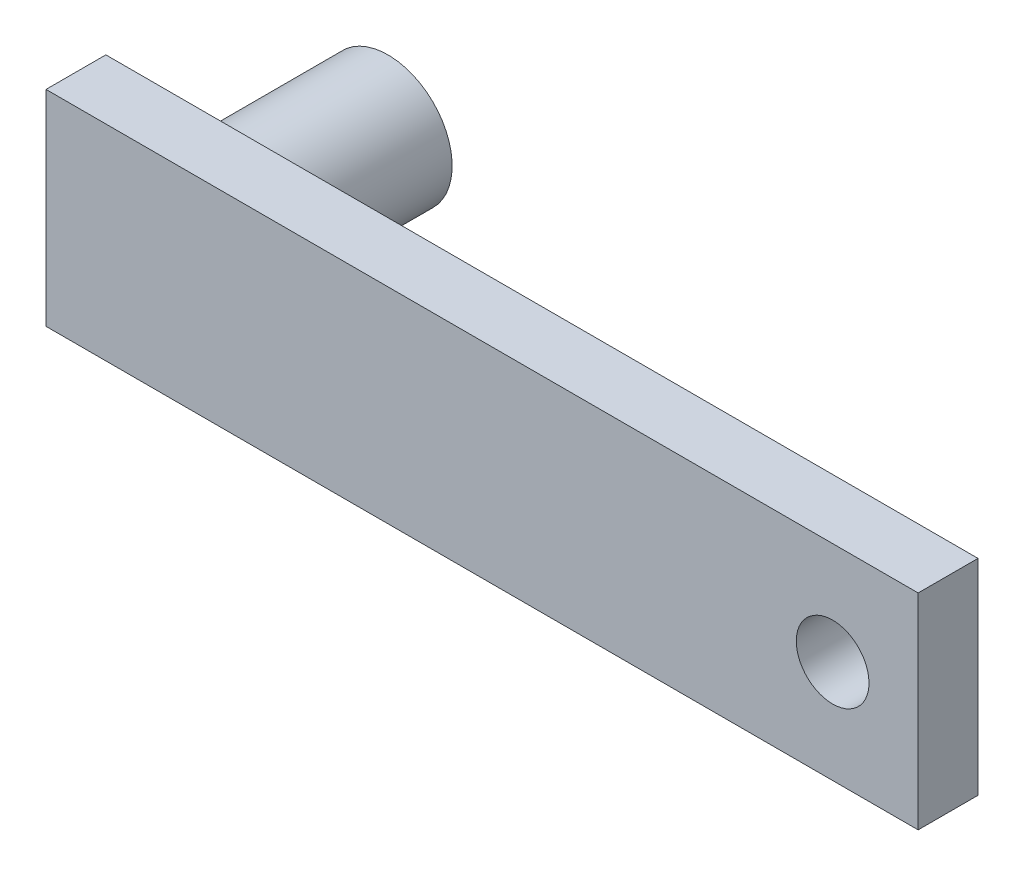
ISO-10303-21;
HEADER;
FILE_DESCRIPTION(('STEP AP214'),'2;1');
FILE_NAME('part.step','',(''),(''),'','','');
FILE_SCHEMA(('AUTOMOTIVE_DESIGN { 1 0 10303 214 1 1 1 1 }'));
ENDSEC;
DATA;
#1=APPLICATION_CONTEXT('core data for automotive mechanical design processes');
#2=APPLICATION_PROTOCOL_DEFINITION('international standard','automotive_design',2000,#1);
#3=PRODUCT_CONTEXT('',#1,'mechanical');
#4=PRODUCT('Part','Part','',(#3));
#5=PRODUCT_RELATED_PRODUCT_CATEGORY('part','',(#4));
#6=PRODUCT_DEFINITION_FORMATION('','',#4);
#7=PRODUCT_DEFINITION_CONTEXT('part definition',#1,'design');
#8=PRODUCT_DEFINITION('design','',#6,#7);
#9=PRODUCT_DEFINITION_SHAPE('','',#8);
#10=(LENGTH_UNIT() NAMED_UNIT(*) SI_UNIT(.MILLI.,.METRE.));
#11=(NAMED_UNIT(*) PLANE_ANGLE_UNIT() SI_UNIT($,.RADIAN.));
#12=(NAMED_UNIT(*) SI_UNIT($,.STERADIAN.) SOLID_ANGLE_UNIT());
#13=UNCERTAINTY_MEASURE_WITH_UNIT(LENGTH_MEASURE(1.E-05),#10,'distance_accuracy_value','');
#14=(GEOMETRIC_REPRESENTATION_CONTEXT(3) GLOBAL_UNCERTAINTY_ASSIGNED_CONTEXT((#13)) GLOBAL_UNIT_ASSIGNED_CONTEXT((#10,
#11,#12)) REPRESENTATION_CONTEXT('',''));
#15=CARTESIAN_POINT('',(0.,0.,0.));
#16=DIRECTION('',(0.,0.,1.));
#17=DIRECTION('',(1.,0.,0.));
#18=AXIS2_PLACEMENT_3D('',#15,#16,#17);
#19=CARTESIAN_POINT('',(0.,0.,20.));
#20=DIRECTION('',(0.,0.,-1.));
#21=DIRECTION('',(-1.,0.,0.));
#22=AXIS2_PLACEMENT_3D('',#19,#20,#21);
#23=PLANE('',#22);
#24=CARTESIAN_POINT('',(0.,0.,20.));
#25=DIRECTION('',(0.,0.,-1.));
#26=DIRECTION('',(-1.,0.,0.));
#27=AXIS2_PLACEMENT_3D('',#24,#25,#26);
#28=CIRCLE('',#27,7.5);
#29=CARTESIAN_POINT('',(-7.5,0.,20.));
#30=VERTEX_POINT('',#29);
#31=CARTESIAN_POINT('',(0.,7.5,20.));
#32=VERTEX_POINT('',#31);
#33=EDGE_CURVE('E25',#30,#32,#28,.T.);
#34=ORIENTED_EDGE('',*,*,#33,.F.);
#35=DIRECTION('',(0.,-1.,0.));
#36=VECTOR('',#35,1.);
#37=CARTESIAN_POINT('',(-7.5,7.5,20.));
#38=LINE('',#37,#36);
#39=CARTESIAN_POINT('',(-7.5,7.5,20.));
#40=VERTEX_POINT('',#39);
#41=EDGE_CURVE('E96',#40,#30,#38,.T.);
#42=ORIENTED_EDGE('',*,*,#41,.F.);
#43=DIRECTION('',(-1.,0.,0.));
#44=VECTOR('',#43,1.);
#45=CARTESIAN_POINT('',(7.5,7.5,20.));
#46=LINE('',#45,#44);
#47=EDGE_CURVE('E112',#32,#40,#46,.T.);
#48=ORIENTED_EDGE('',*,*,#47,.F.);
#49=EDGE_LOOP('',(#34,#42,#48));
#50=FACE_BOUND('',#49,.T.);
#51=ADVANCED_FACE('F14',(#50),#23,.T.);
#52=CARTESIAN_POINT('',(7.5,0.,20.));
#53=VERTEX_POINT('',#52);
#54=EDGE_CURVE('E9',#32,#53,#28,.T.);
#55=ORIENTED_EDGE('',*,*,#54,.F.);
#56=CARTESIAN_POINT('',(7.5,7.5,20.));
#57=VERTEX_POINT('',#56);
#58=EDGE_CURVE('E110',#57,#32,#46,.T.);
#59=ORIENTED_EDGE('',*,*,#58,.F.);
#60=DIRECTION('',(0.,1.,0.));
#61=VECTOR('',#60,1.);
#62=CARTESIAN_POINT('',(7.5,7.5,20.));
#63=LINE('',#62,#61);
#64=EDGE_CURVE('E169',#53,#57,#63,.T.);
#65=ORIENTED_EDGE('',*,*,#64,.F.);
#66=EDGE_LOOP('',(#55,#59,#65));
#67=FACE_BOUND('',#66,.T.);
#68=ADVANCED_FACE('F189',(#67),#23,.T.);
#69=CARTESIAN_POINT('',(0.,-7.5,20.));
#70=VERTEX_POINT('',#69);
#71=EDGE_CURVE('E23',#53,#70,#28,.T.);
#72=ORIENTED_EDGE('',*,*,#71,.F.);
#73=CARTESIAN_POINT('',(7.5,-7.5,20.));
#74=VERTEX_POINT('',#73);
#75=EDGE_CURVE('E157',#74,#53,#63,.T.);
#76=ORIENTED_EDGE('',*,*,#75,.F.);
#77=DIRECTION('',(1.,0.,0.));
#78=VECTOR('',#77,1.);
#79=CARTESIAN_POINT('',(7.5,-7.5,20.));
#80=LINE('',#79,#78);
#81=EDGE_CURVE('E104',#70,#74,#80,.T.);
#82=ORIENTED_EDGE('',*,*,#81,.F.);
#83=EDGE_LOOP('',(#72,#76,#82));
#84=FACE_BOUND('',#83,.T.);
#85=ADVANCED_FACE('F190',(#84),#23,.T.);
#86=CARTESIAN_POINT('',(7.5,7.5,21.));
#87=DIRECTION('',(0.,-1.,0.));
#88=DIRECTION('',(1.,0.,0.));
#89=AXIS2_PLACEMENT_3D('',#86,#87,#88);
#90=PLANE('',#89);
#91=ORIENTED_EDGE('',*,*,#58,.T.);
#92=ORIENTED_EDGE('',*,*,#47,.T.);
#93=DIRECTION('',(0.,0.,-1.));
#94=VECTOR('',#93,1.);
#95=CARTESIAN_POINT('',(-7.5,7.5,21.));
#96=LINE('',#95,#94);
#97=CARTESIAN_POINT('',(-7.5,7.5,21.));
#98=VERTEX_POINT('',#97);
#99=EDGE_CURVE('E100',#98,#40,#96,.T.);
#100=ORIENTED_EDGE('',*,*,#99,.F.);
#101=DIRECTION('',(-1.,0.,0.));
#102=VECTOR('',#101,1.);
#103=CARTESIAN_POINT('',(7.5,7.5,21.));
#104=LINE('',#103,#102);
#105=CARTESIAN_POINT('',(7.5,7.5,21.));
#106=VERTEX_POINT('',#105);
#107=EDGE_CURVE('E153',#106,#98,#104,.T.);
#108=ORIENTED_EDGE('',*,*,#107,.F.);
#109=DIRECTION('',(0.,0.,-1.));
#110=VECTOR('',#109,1.);
#111=CARTESIAN_POINT('',(7.5,7.5,21.));
#112=LINE('',#111,#110);
#113=EDGE_CURVE('E166',#106,#57,#112,.T.);
#114=ORIENTED_EDGE('',*,*,#113,.T.);
#115=EDGE_LOOP('',(#91,#92,#100,#108,#114));
#116=FACE_BOUND('',#115,.T.);
#117=ADVANCED_FACE('F16',(#116),#90,.F.);
#118=CARTESIAN_POINT('',(-7.5,7.5,21.));
#119=DIRECTION('',(1.,0.,0.));
#120=DIRECTION('',(0.,0.,1.));
#121=AXIS2_PLACEMENT_3D('',#118,#119,#120);
#122=PLANE('',#121);
#123=ORIENTED_EDGE('',*,*,#41,.T.);
#124=CARTESIAN_POINT('',(-7.5,-7.5,20.));
#125=VERTEX_POINT('',#124);
#126=EDGE_CURVE('E98',#30,#125,#38,.T.);
#127=ORIENTED_EDGE('',*,*,#126,.T.);
#128=DIRECTION('',(0.,0.,-1.));
#129=VECTOR('',#128,1.);
#130=CARTESIAN_POINT('',(-7.5,-7.5,21.));
#131=LINE('',#130,#129);
#132=CARTESIAN_POINT('',(-7.5,-7.5,21.));
#133=VERTEX_POINT('',#132);
#134=EDGE_CURVE('E117',#133,#125,#131,.T.);
#135=ORIENTED_EDGE('',*,*,#134,.F.);
#136=DIRECTION('',(0.,-1.,0.));
#137=VECTOR('',#136,1.);
#138=CARTESIAN_POINT('',(-7.5,7.5,21.));
#139=LINE('',#138,#137);
#140=EDGE_CURVE('E156',#98,#133,#139,.T.);
#141=ORIENTED_EDGE('',*,*,#140,.F.);
#142=ORIENTED_EDGE('',*,*,#99,.T.);
#143=EDGE_LOOP('',(#123,#127,#135,#141,#142));
#144=FACE_BOUND('',#143,.T.);
#145=ADVANCED_FACE('F97',(#144),#122,.F.);
#146=CARTESIAN_POINT('',(7.5,-7.5,21.));
#147=DIRECTION('',(0.,1.,0.));
#148=DIRECTION('',(-1.,0.,0.));
#149=AXIS2_PLACEMENT_3D('',#146,#147,#148);
#150=PLANE('',#149);
#151=EDGE_CURVE('E108',#125,#70,#80,.T.);
#152=ORIENTED_EDGE('',*,*,#151,.T.);
#153=ORIENTED_EDGE('',*,*,#81,.T.);
#154=DIRECTION('',(0.,0.,-1.));
#155=VECTOR('',#154,1.);
#156=CARTESIAN_POINT('',(7.5,-7.5,21.));
#157=LINE('',#156,#155);
#158=CARTESIAN_POINT('',(7.5,-7.5,21.));
#159=VERTEX_POINT('',#158);
#160=EDGE_CURVE('E174',#159,#74,#157,.T.);
#161=ORIENTED_EDGE('',*,*,#160,.F.);
#162=DIRECTION('',(1.,0.,0.));
#163=VECTOR('',#162,1.);
#164=CARTESIAN_POINT('',(7.5,-7.5,21.));
#165=LINE('',#164,#163);
#166=EDGE_CURVE('E160',#133,#159,#165,.T.);
#167=ORIENTED_EDGE('',*,*,#166,.F.);
#168=ORIENTED_EDGE('',*,*,#134,.T.);
#169=EDGE_LOOP('',(#152,#153,#161,#167,#168));
#170=FACE_BOUND('',#169,.T.);
#171=ADVANCED_FACE('F179',(#170),#150,.F.);
#172=CARTESIAN_POINT('',(7.5,7.5,21.));
#173=DIRECTION('',(-1.,0.,0.));
#174=DIRECTION('',(0.,0.,-1.));
#175=AXIS2_PLACEMENT_3D('',#172,#173,#174);
#176=PLANE('',#175);
#177=ORIENTED_EDGE('',*,*,#75,.T.);
#178=ORIENTED_EDGE('',*,*,#64,.T.);
#179=ORIENTED_EDGE('',*,*,#113,.F.);
#180=DIRECTION('',(0.,1.,0.));
#181=VECTOR('',#180,1.);
#182=CARTESIAN_POINT('',(7.5,7.5,21.));
#183=LINE('',#182,#181);
#184=EDGE_CURVE('E163',#159,#106,#183,.T.);
#185=ORIENTED_EDGE('',*,*,#184,.F.);
#186=ORIENTED_EDGE('',*,*,#160,.T.);
#187=EDGE_LOOP('',(#177,#178,#179,#185,#186));
#188=FACE_BOUND('',#187,.T.);
#189=ADVANCED_FACE('F186',(#188),#176,.F.);
#190=CARTESIAN_POINT('',(-12.,12.,21.));
#191=DIRECTION('',(0.,0.,1.));
#192=DIRECTION('',(0.,-1.,0.));
#193=AXIS2_PLACEMENT_3D('',#190,#191,#192);
#194=PLANE('',#193);
#195=CARTESIAN_POINT('',(80.,0.,21.));
#196=DIRECTION('',(0.,0.,1.));
#197=DIRECTION('',(0.,-1.,0.));
#198=AXIS2_PLACEMENT_3D('',#195,#196,#197);
#199=CIRCLE('',#198,4.25);
#200=CARTESIAN_POINT('',(80.,-4.25,21.));
#201=VERTEX_POINT('',#200);
#202=EDGE_CURVE('E18',#201,#201,#199,.T.);
#203=ORIENTED_EDGE('',*,*,#202,.T.);
#204=EDGE_LOOP('',(#203));
#205=FACE_BOUND('',#204,.T.);
#206=DIRECTION('',(-1.,0.,0.));
#207=VECTOR('',#206,1.);
#208=CARTESIAN_POINT('',(90.,12.,21.));
#209=LINE('',#208,#207);
#210=CARTESIAN_POINT('',(90.,12.,21.));
#211=VERTEX_POINT('',#210);
#212=CARTESIAN_POINT('',(-12.,12.,21.));
#213=VERTEX_POINT('',#212);
#214=EDGE_CURVE('E134',#211,#213,#209,.T.);
#215=ORIENTED_EDGE('',*,*,#214,.F.);
#216=DIRECTION('',(0.,1.,0.));
#217=VECTOR('',#216,1.);
#218=CARTESIAN_POINT('',(90.,12.,21.));
#219=LINE('',#218,#217);
#220=CARTESIAN_POINT('',(90.,-12.,21.));
#221=VERTEX_POINT('',#220);
#222=EDGE_CURVE('E127',#221,#211,#219,.T.);
#223=ORIENTED_EDGE('',*,*,#222,.F.);
#224=DIRECTION('',(1.,0.,0.));
#225=VECTOR('',#224,1.);
#226=CARTESIAN_POINT('',(90.,-12.,21.));
#227=LINE('',#226,#225);
#228=CARTESIAN_POINT('',(-12.,-12.,21.));
#229=VERTEX_POINT('',#228);
#230=EDGE_CURVE('E139',#229,#221,#227,.T.);
#231=ORIENTED_EDGE('',*,*,#230,.F.);
#232=DIRECTION('',(0.,-1.,0.));
#233=VECTOR('',#232,1.);
#234=CARTESIAN_POINT('',(-12.,12.,21.));
#235=LINE('',#234,#233);
#236=EDGE_CURVE('E137',#213,#229,#235,.T.);
#237=ORIENTED_EDGE('',*,*,#236,.F.);
#238=EDGE_LOOP('',(#215,#223,#231,#237));
#239=FACE_BOUND('',#238,.T.);
#240=ORIENTED_EDGE('',*,*,#184,.T.);
#241=ORIENTED_EDGE('',*,*,#107,.T.);
#242=ORIENTED_EDGE('',*,*,#140,.T.);
#243=ORIENTED_EDGE('',*,*,#166,.T.);
#244=EDGE_LOOP('',(#240,#241,#242,#243));
#245=FACE_BOUND('',#244,.T.);
#246=ADVANCED_FACE('F183',(#205,#239,#245),#194,.F.);
#247=CARTESIAN_POINT('',(90.,12.,28.));
#248=DIRECTION('',(0.,-1.,0.));
#249=DIRECTION('',(1.,0.,0.));
#250=AXIS2_PLACEMENT_3D('',#247,#248,#249);
#251=PLANE('',#250);
#252=ORIENTED_EDGE('',*,*,#214,.T.);
#253=DIRECTION('',(0.,0.,-1.));
#254=VECTOR('',#253,1.);
#255=CARTESIAN_POINT('',(-12.,12.,28.));
#256=LINE('',#255,#254);
#257=CARTESIAN_POINT('',(-12.,12.,28.));
#258=VERTEX_POINT('',#257);
#259=EDGE_CURVE('E150',#258,#213,#256,.T.);
#260=ORIENTED_EDGE('',*,*,#259,.F.);
#261=DIRECTION('',(-1.,0.,0.));
#262=VECTOR('',#261,1.);
#263=CARTESIAN_POINT('',(90.,12.,28.));
#264=LINE('',#263,#262);
#265=CARTESIAN_POINT('',(90.,12.,28.));
#266=VERTEX_POINT('',#265);
#267=EDGE_CURVE('E123',#266,#258,#264,.T.);
#268=ORIENTED_EDGE('',*,*,#267,.F.);
#269=DIRECTION('',(0.,0.,-1.));
#270=VECTOR('',#269,1.);
#271=CARTESIAN_POINT('',(90.,12.,28.));
#272=LINE('',#271,#270);
#273=EDGE_CURVE('E133',#266,#211,#272,.T.);
#274=ORIENTED_EDGE('',*,*,#273,.T.);
#275=EDGE_LOOP('',(#252,#260,#268,#274));
#276=FACE_BOUND('',#275,.T.);
#277=ADVANCED_FACE('F292',(#276),#251,.F.);
#278=CARTESIAN_POINT('',(-12.,12.,28.));
#279=DIRECTION('',(1.,0.,0.));
#280=DIRECTION('',(0.,1.,0.));
#281=AXIS2_PLACEMENT_3D('',#278,#279,#280);
#282=PLANE('',#281);
#283=ORIENTED_EDGE('',*,*,#236,.T.);
#284=DIRECTION('',(0.,0.,-1.));
#285=VECTOR('',#284,1.);
#286=CARTESIAN_POINT('',(-12.,-12.,28.));
#287=LINE('',#286,#285);
#288=CARTESIAN_POINT('',(-12.,-12.,28.));
#289=VERTEX_POINT('',#288);
#290=EDGE_CURVE('E147',#289,#229,#287,.T.);
#291=ORIENTED_EDGE('',*,*,#290,.F.);
#292=DIRECTION('',(0.,-1.,0.));
#293=VECTOR('',#292,1.);
#294=CARTESIAN_POINT('',(-12.,12.,28.));
#295=LINE('',#294,#293);
#296=EDGE_CURVE('E126',#258,#289,#295,.T.);
#297=ORIENTED_EDGE('',*,*,#296,.F.);
#298=ORIENTED_EDGE('',*,*,#259,.T.);
#299=EDGE_LOOP('',(#283,#291,#297,#298));
#300=FACE_BOUND('',#299,.T.);
#301=ADVANCED_FACE('F282',(#300),#282,.F.);
#302=CARTESIAN_POINT('',(90.,-12.,28.));
#303=DIRECTION('',(0.,1.,0.));
#304=DIRECTION('',(-1.,0.,0.));
#305=AXIS2_PLACEMENT_3D('',#302,#303,#304);
#306=PLANE('',#305);
#307=ORIENTED_EDGE('',*,*,#230,.T.);
#308=DIRECTION('',(0.,0.,-1.));
#309=VECTOR('',#308,1.);
#310=CARTESIAN_POINT('',(90.,-12.,28.));
#311=LINE('',#310,#309);
#312=CARTESIAN_POINT('',(90.,-12.,28.));
#313=VERTEX_POINT('',#312);
#314=EDGE_CURVE('E144',#313,#221,#311,.T.);
#315=ORIENTED_EDGE('',*,*,#314,.F.);
#316=DIRECTION('',(1.,0.,0.));
#317=VECTOR('',#316,1.);
#318=CARTESIAN_POINT('',(90.,-12.,28.));
#319=LINE('',#318,#317);
#320=EDGE_CURVE('E129',#289,#313,#319,.T.);
#321=ORIENTED_EDGE('',*,*,#320,.F.);
#322=ORIENTED_EDGE('',*,*,#290,.T.);
#323=EDGE_LOOP('',(#307,#315,#321,#322));
#324=FACE_BOUND('',#323,.T.);
#325=ADVANCED_FACE('F272',(#324),#306,.F.);
#326=CARTESIAN_POINT('',(90.,12.,28.));
#327=DIRECTION('',(-1.,0.,0.));
#328=DIRECTION('',(0.,0.,-1.));
#329=AXIS2_PLACEMENT_3D('',#326,#327,#328);
#330=PLANE('',#329);
#331=ORIENTED_EDGE('',*,*,#222,.T.);
#332=ORIENTED_EDGE('',*,*,#273,.F.);
#333=DIRECTION('',(0.,1.,0.));
#334=VECTOR('',#333,1.);
#335=CARTESIAN_POINT('',(90.,12.,28.));
#336=LINE('',#335,#334);
#337=EDGE_CURVE('E131',#313,#266,#336,.T.);
#338=ORIENTED_EDGE('',*,*,#337,.F.);
#339=ORIENTED_EDGE('',*,*,#314,.T.);
#340=EDGE_LOOP('',(#331,#332,#338,#339));
#341=FACE_BOUND('',#340,.T.);
#342=ADVANCED_FACE('F262',(#341),#330,.F.);
#343=CARTESIAN_POINT('',(-12.,12.,28.));
#344=DIRECTION('',(0.,0.,1.));
#345=DIRECTION('',(0.,-1.,0.));
#346=AXIS2_PLACEMENT_3D('',#343,#344,#345);
#347=PLANE('',#346);
#348=CARTESIAN_POINT('',(80.,0.,28.));
#349=DIRECTION('',(0.,0.,1.));
#350=DIRECTION('',(0.,-1.,0.));
#351=AXIS2_PLACEMENT_3D('',#348,#349,#350);
#352=CIRCLE('',#351,4.25);
#353=CARTESIAN_POINT('',(80.,-4.25,28.));
#354=VERTEX_POINT('',#353);
#355=EDGE_CURVE('E120',#354,#354,#352,.T.);
#356=ORIENTED_EDGE('',*,*,#355,.F.);
#357=EDGE_LOOP('',(#356));
#358=FACE_BOUND('',#357,.T.);
#359=ORIENTED_EDGE('',*,*,#267,.T.);
#360=ORIENTED_EDGE('',*,*,#296,.T.);
#361=ORIENTED_EDGE('',*,*,#320,.T.);
#362=ORIENTED_EDGE('',*,*,#337,.T.);
#363=EDGE_LOOP('',(#359,#360,#361,#362));
#364=FACE_BOUND('',#363,.T.);
#365=ADVANCED_FACE('F256',(#358,#364),#347,.T.);
#366=CARTESIAN_POINT('',(80.,0.,28.));
#367=DIRECTION('',(0.,0.,1.));
#368=DIRECTION('',(0.,-1.,0.));
#369=AXIS2_PLACEMENT_3D('',#366,#367,#368);
#370=CYLINDRICAL_SURFACE('',#369,4.25);
#371=ORIENTED_EDGE('',*,*,#355,.T.);
#372=EDGE_LOOP('',(#371));
#373=FACE_BOUND('',#372,.T.);
#374=ORIENTED_EDGE('',*,*,#202,.F.);
#375=EDGE_LOOP('',(#374));
#376=FACE_BOUND('',#375,.T.);
#377=ADVANCED_FACE('F202',(#373,#376),#370,.F.);
#378=EDGE_CURVE('E32',#70,#30,#28,.T.);
#379=ORIENTED_EDGE('',*,*,#378,.F.);
#380=ORIENTED_EDGE('',*,*,#151,.F.);
#381=ORIENTED_EDGE('',*,*,#126,.F.);
#382=EDGE_LOOP('',(#379,#380,#381));
#383=FACE_BOUND('',#382,.T.);
#384=ADVANCED_FACE('F106',(#383),#23,.T.);
#385=CARTESIAN_POINT('',(0.,0.,0.));
#386=DIRECTION('',(0.,0.,1.));
#387=DIRECTION('',(1.,0.,0.));
#388=AXIS2_PLACEMENT_3D('',#385,#386,#387);
#389=CYLINDRICAL_SURFACE('',#388,7.5);
#390=CARTESIAN_POINT('',(0.,0.,0.));
#391=DIRECTION('',(0.,0.,-1.));
#392=DIRECTION('',(-1.,0.,0.));
#393=AXIS2_PLACEMENT_3D('',#390,#391,#392);
#394=CIRCLE('',#393,7.5);
#395=CARTESIAN_POINT('',(-7.5,0.,0.));
#396=VERTEX_POINT('',#395);
#397=EDGE_CURVE('E115',#396,#396,#394,.T.);
#398=ORIENTED_EDGE('',*,*,#397,.F.);
#399=EDGE_LOOP('',(#398));
#400=FACE_BOUND('',#399,.T.);
#401=ORIENTED_EDGE('',*,*,#33,.T.);
#402=ORIENTED_EDGE('',*,*,#54,.T.);
#403=ORIENTED_EDGE('',*,*,#71,.T.);
#404=ORIENTED_EDGE('',*,*,#378,.T.);
#405=EDGE_LOOP('',(#401,#402,#403,#404));
#406=FACE_BOUND('',#405,.T.);
#407=ADVANCED_FACE('F116',(#400,#406),#389,.T.);
#408=CARTESIAN_POINT('',(0.,0.,0.));
#409=DIRECTION('',(0.,0.,-1.));
#410=DIRECTION('',(-1.,0.,0.));
#411=AXIS2_PLACEMENT_3D('',#408,#409,#410);
#412=PLANE('',#411);
#413=ORIENTED_EDGE('',*,*,#397,.T.);
#414=EDGE_LOOP('',(#413));
#415=FACE_BOUND('',#414,.T.);
#416=ADVANCED_FACE('F243',(#415),#412,.T.);
#417=CLOSED_SHELL('',(#51,#68,#85,#117,#145,#171,#189,#246,#277,#301,#325,#342,#365,#377,#384,
#407,#416));
#418=MANIFOLD_SOLID_BREP('B1',#417);
#419=ADVANCED_BREP_SHAPE_REPRESENTATION('',(#18,#418),#14);
#420=SHAPE_DEFINITION_REPRESENTATION(#9,#419);
ENDSEC;
END-ISO-10303-21;
